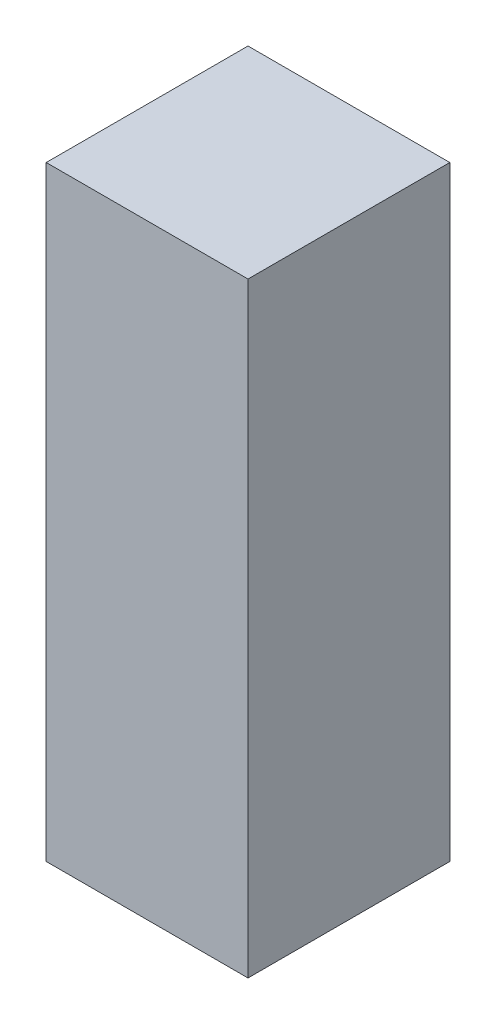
from build123d import *

# Parameters (mm, degrees)
SKETCH1_W           = 1.27
SKETCH1_H           = 1.27
BOSS_EXTRUDE1_DEPTH = 3.81


with BuildPart() as part:
    # Sketch1 → Boss-Extrude1 (new body)
    with BuildSketch(Plane(origin=(0, 0, 0), x_dir=(1, 0, 0), z_dir=(0, 1, 0))):
        Rectangle(SKETCH1_W, SKETCH1_H)
    extrude(amount=BOSS_EXTRUDE1_DEPTH)


solid = part.part
